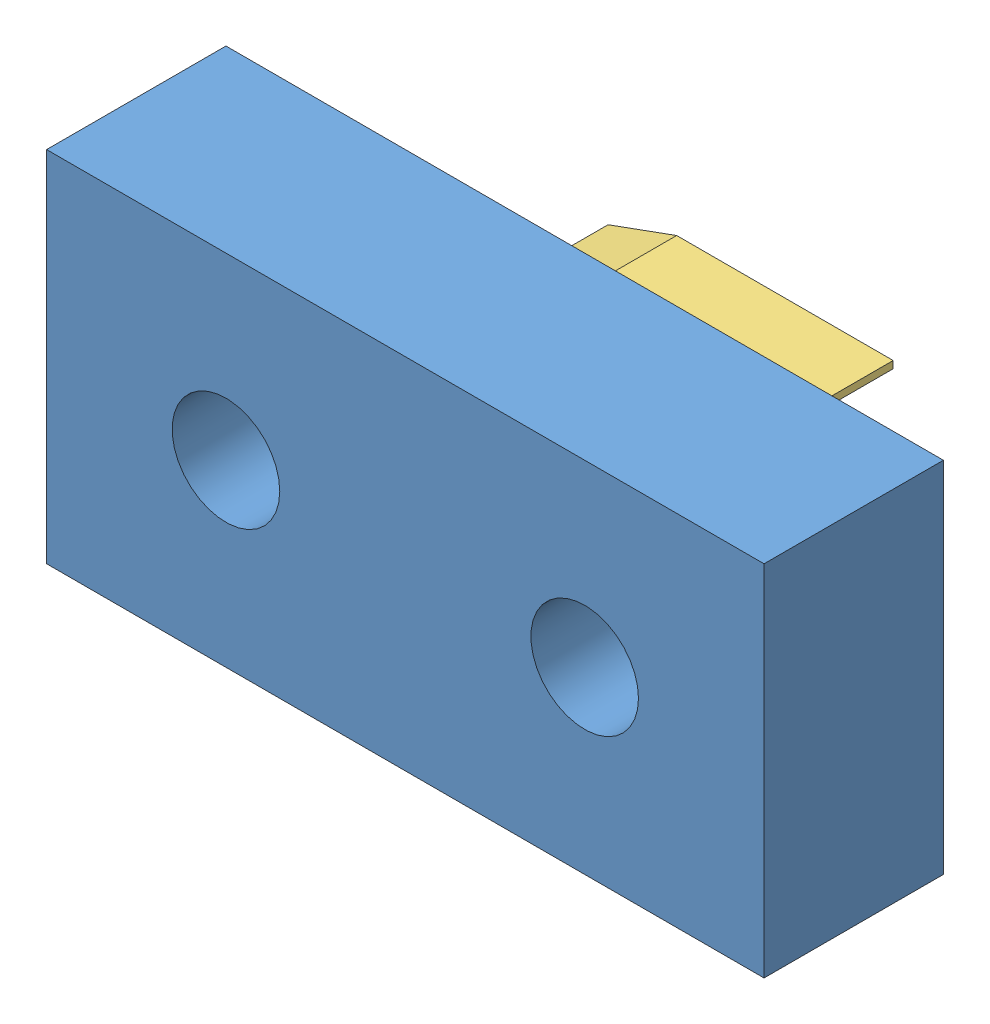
SolidWorks assembly Baugruppe1.SLDASM, configuration Standard (file format 3100). Lengths in mm.
Overall size (200 100 95).
4 component instances, 3 part files, 8 mates.
Components (placement in the parent):
- Teil2-1: Teil2.SLDPRT [Standard] at origin size (200 100 50)
- Teil4-1: Teil4.SLDPRT [Standard] at (50 0 -30) x (0.877533 -0.479516 0) z (-0.479516 -0.877533 0) size (40 36 40)
- Teil4-2: Teil4.SLDPRT [Standard] at (-50 0 -30) x (0.877533 -0.479516 0) z (-0.479516 -0.877533 0) size (40 36 40)
- Blech-1: Blech.SLDPRT [Standard] at (0 0 -10) size (79.48 8.84 35)
Mates (geometry in assembly coordinates):
- Konzentrisch1: concentric aligned: cylinder of Teil2-1; cylinder of Teil4-1
- Abstand1: distance = 10 mm anti-aligned: plane of Teil2-1 through (-100 -50 0) normal (0 0 -1); plane of Teil4-1 through (63.163 -7.1927 -10) normal (0 0 1)
- Konzentrisch2: concentric aligned: cylinder of Teil2-1; cylinder of Teil4-2
- Deckungsgleich3: coincident aligned: plane of Teil4-1 through (57.0203 -3.8361 -30) normal (0 0 -1); plane of Teil4-2 through (-42.9797 -3.8361 -30) normal (0 0 -1)
- Platziert1: in place: plane of assembly; plane of Blech-1; moOrthogonalPlaneRef_w of assembly; plane of Blech-1; moOrthogonalPlaneRef_w of assembly; plane of Blech-1
- Deckungsgleich4: coincident aligned: plane of Blech-1; plane of assembly
- Deckungsgleich5: coincident aligned: plane of Blech-1; moOrthogonalPlaneRef_w of assembly
- Deckungsgleich6: coincident anti-aligned: plane of Blech-1; moOrthogonalPlaneRef_w of assembly
